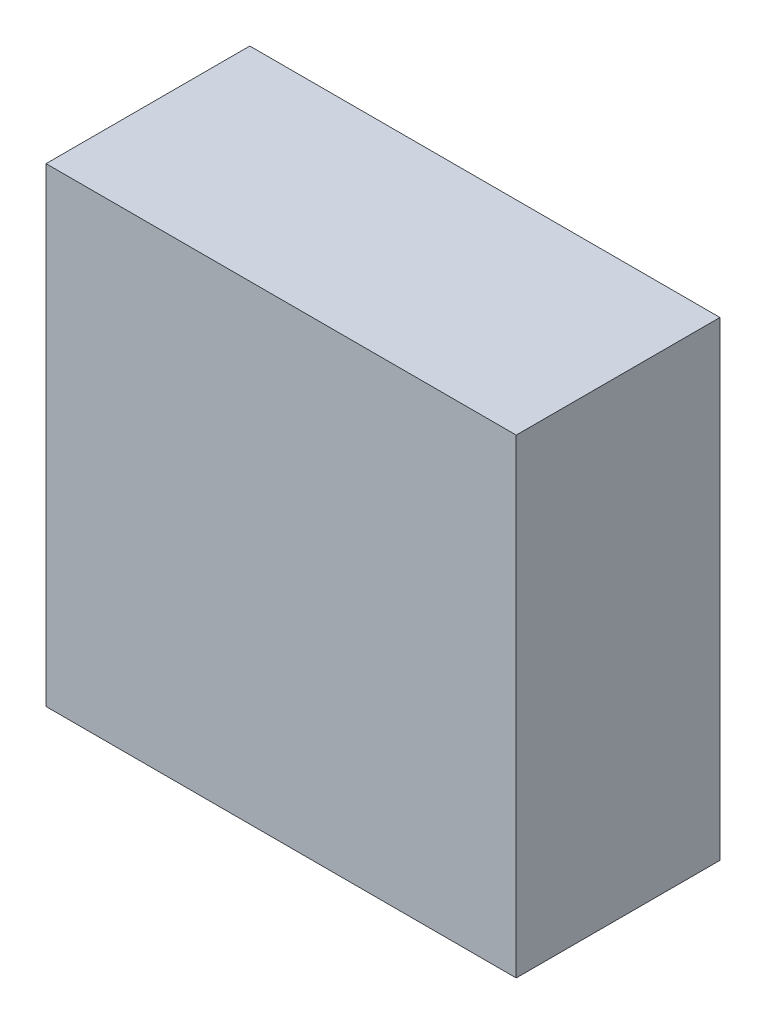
ISO-10303-21;
HEADER;
FILE_DESCRIPTION(('STEP AP214'),'2;1');
FILE_NAME('part.step','',(''),(''),'','','');
FILE_SCHEMA(('AUTOMOTIVE_DESIGN { 1 0 10303 214 1 1 1 1 }'));
ENDSEC;
DATA;
#1=APPLICATION_CONTEXT('core data for automotive mechanical design processes');
#2=APPLICATION_PROTOCOL_DEFINITION('international standard','automotive_design',2000,#1);
#3=PRODUCT_CONTEXT('',#1,'mechanical');
#4=PRODUCT('Part','Part','',(#3));
#5=PRODUCT_RELATED_PRODUCT_CATEGORY('part','',(#4));
#6=PRODUCT_DEFINITION_FORMATION('','',#4);
#7=PRODUCT_DEFINITION_CONTEXT('part definition',#1,'design');
#8=PRODUCT_DEFINITION('design','',#6,#7);
#9=PRODUCT_DEFINITION_SHAPE('','',#8);
#10=(LENGTH_UNIT() NAMED_UNIT(*) SI_UNIT(.MILLI.,.METRE.));
#11=(NAMED_UNIT(*) PLANE_ANGLE_UNIT() SI_UNIT($,.RADIAN.));
#12=(NAMED_UNIT(*) SI_UNIT($,.STERADIAN.) SOLID_ANGLE_UNIT());
#13=UNCERTAINTY_MEASURE_WITH_UNIT(LENGTH_MEASURE(1.E-05),#10,'distance_accuracy_value','');
#14=(GEOMETRIC_REPRESENTATION_CONTEXT(3) GLOBAL_UNCERTAINTY_ASSIGNED_CONTEXT((#13)) GLOBAL_UNIT_ASSIGNED_CONTEXT((#10,
#11,#12)) REPRESENTATION_CONTEXT('',''));
#15=CARTESIAN_POINT('',(0.,0.,0.));
#16=DIRECTION('',(0.,0.,1.));
#17=DIRECTION('',(1.,0.,0.));
#18=AXIS2_PLACEMENT_3D('',#15,#16,#17);
#19=CARTESIAN_POINT('',(1.5,1.5,1.3));
#20=DIRECTION('',(-1.,0.,0.));
#21=DIRECTION('',(0.,-1.,0.));
#22=AXIS2_PLACEMENT_3D('',#19,#20,#21);
#23=PLANE('',#22);
#24=DIRECTION('',(0.,1.,0.));
#25=VECTOR('',#24,1.);
#26=CARTESIAN_POINT('',(1.5,1.5,0.));
#27=LINE('',#26,#25);
#28=CARTESIAN_POINT('',(1.5,-1.5,0.));
#29=VERTEX_POINT('',#28);
#30=CARTESIAN_POINT('',(1.5,1.5,0.));
#31=VERTEX_POINT('',#30);
#32=EDGE_CURVE('E97',#29,#31,#27,.T.);
#33=ORIENTED_EDGE('',*,*,#32,.T.);
#34=DIRECTION('',(0.,0.,-1.));
#35=VECTOR('',#34,1.);
#36=CARTESIAN_POINT('',(1.5,1.5,1.3));
#37=LINE('',#36,#35);
#38=CARTESIAN_POINT('',(1.5,1.5,1.3));
#39=VERTEX_POINT('',#38);
#40=EDGE_CURVE('E11',#39,#31,#37,.T.);
#41=ORIENTED_EDGE('',*,*,#40,.F.);
#42=DIRECTION('',(0.,1.,0.));
#43=VECTOR('',#42,1.);
#44=CARTESIAN_POINT('',(1.5,1.5,1.3));
#45=LINE('',#44,#43);
#46=CARTESIAN_POINT('',(1.5,-1.5,1.3));
#47=VERTEX_POINT('',#46);
#48=EDGE_CURVE('E85',#47,#39,#45,.T.);
#49=ORIENTED_EDGE('',*,*,#48,.F.);
#50=DIRECTION('',(0.,0.,-1.));
#51=VECTOR('',#50,1.);
#52=CARTESIAN_POINT('',(1.5,-1.5,1.3));
#53=LINE('',#52,#51);
#54=EDGE_CURVE('E93',#47,#29,#53,.T.);
#55=ORIENTED_EDGE('',*,*,#54,.T.);
#56=EDGE_LOOP('',(#33,#41,#49,#55));
#57=FACE_BOUND('',#56,.T.);
#58=ADVANCED_FACE('F34',(#57),#23,.F.);
#59=CARTESIAN_POINT('',(-1.5,1.5,1.3));
#60=DIRECTION('',(0.,-1.,0.));
#61=DIRECTION('',(0.,0.,-1.));
#62=AXIS2_PLACEMENT_3D('',#59,#60,#61);
#63=PLANE('',#62);
#64=DIRECTION('',(-1.,0.,0.));
#65=VECTOR('',#64,1.);
#66=CARTESIAN_POINT('',(-1.5,1.5,0.));
#67=LINE('',#66,#65);
#68=CARTESIAN_POINT('',(-1.5,1.5,0.));
#69=VERTEX_POINT('',#68);
#70=EDGE_CURVE('E89',#31,#69,#67,.T.);
#71=ORIENTED_EDGE('',*,*,#70,.T.);
#72=DIRECTION('',(0.,0.,-1.));
#73=VECTOR('',#72,1.);
#74=CARTESIAN_POINT('',(-1.5,1.5,1.3));
#75=LINE('',#74,#73);
#76=CARTESIAN_POINT('',(-1.5,1.5,1.3));
#77=VERTEX_POINT('',#76);
#78=EDGE_CURVE('E42',#77,#69,#75,.T.);
#79=ORIENTED_EDGE('',*,*,#78,.F.);
#80=DIRECTION('',(-1.,0.,0.));
#81=VECTOR('',#80,1.);
#82=CARTESIAN_POINT('',(-1.5,1.5,1.3));
#83=LINE('',#82,#81);
#84=EDGE_CURVE('E80',#39,#77,#83,.T.);
#85=ORIENTED_EDGE('',*,*,#84,.F.);
#86=ORIENTED_EDGE('',*,*,#40,.T.);
#87=EDGE_LOOP('',(#71,#79,#85,#86));
#88=FACE_BOUND('',#87,.T.);
#89=ADVANCED_FACE('F88',(#88),#63,.F.);
#90=CARTESIAN_POINT('',(-1.5,1.5,1.3));
#91=DIRECTION('',(1.,0.,0.));
#92=DIRECTION('',(0.,1.,0.));
#93=AXIS2_PLACEMENT_3D('',#90,#91,#92);
#94=PLANE('',#93);
#95=DIRECTION('',(0.,-1.,0.));
#96=VECTOR('',#95,1.);
#97=CARTESIAN_POINT('',(-1.5,1.5,0.));
#98=LINE('',#97,#96);
#99=CARTESIAN_POINT('',(-1.5,-1.5,0.));
#100=VERTEX_POINT('',#99);
#101=EDGE_CURVE('E67',#69,#100,#98,.T.);
#102=ORIENTED_EDGE('',*,*,#101,.T.);
#103=DIRECTION('',(0.,0.,-1.));
#104=VECTOR('',#103,1.);
#105=CARTESIAN_POINT('',(-1.5,-1.5,1.3));
#106=LINE('',#105,#104);
#107=CARTESIAN_POINT('',(-1.5,-1.5,1.3));
#108=VERTEX_POINT('',#107);
#109=EDGE_CURVE('E90',#108,#100,#106,.T.);
#110=ORIENTED_EDGE('',*,*,#109,.F.);
#111=DIRECTION('',(0.,-1.,0.));
#112=VECTOR('',#111,1.);
#113=CARTESIAN_POINT('',(-1.5,1.5,1.3));
#114=LINE('',#113,#112);
#115=EDGE_CURVE('E83',#77,#108,#114,.T.);
#116=ORIENTED_EDGE('',*,*,#115,.F.);
#117=ORIENTED_EDGE('',*,*,#78,.T.);
#118=EDGE_LOOP('',(#102,#110,#116,#117));
#119=FACE_BOUND('',#118,.T.);
#120=ADVANCED_FACE('F91',(#119),#94,.F.);
#121=CARTESIAN_POINT('',(-1.5,-1.5,1.3));
#122=DIRECTION('',(0.,1.,0.));
#123=DIRECTION('',(0.,0.,1.));
#124=AXIS2_PLACEMENT_3D('',#121,#122,#123);
#125=PLANE('',#124);
#126=DIRECTION('',(1.,0.,0.));
#127=VECTOR('',#126,1.);
#128=CARTESIAN_POINT('',(-1.5,-1.5,0.));
#129=LINE('',#128,#127);
#130=EDGE_CURVE('E73',#100,#29,#129,.T.);
#131=ORIENTED_EDGE('',*,*,#130,.T.);
#132=ORIENTED_EDGE('',*,*,#54,.F.);
#133=DIRECTION('',(1.,0.,0.));
#134=VECTOR('',#133,1.);
#135=CARTESIAN_POINT('',(-1.5,-1.5,1.3));
#136=LINE('',#135,#134);
#137=EDGE_CURVE('E50',#108,#47,#136,.T.);
#138=ORIENTED_EDGE('',*,*,#137,.F.);
#139=ORIENTED_EDGE('',*,*,#109,.T.);
#140=EDGE_LOOP('',(#131,#132,#138,#139));
#141=FACE_BOUND('',#140,.T.);
#142=ADVANCED_FACE('F104',(#141),#125,.F.);
#143=CARTESIAN_POINT('',(0.,0.,1.3));
#144=DIRECTION('',(0.,0.,1.));
#145=DIRECTION('',(1.,0.,0.));
#146=AXIS2_PLACEMENT_3D('',#143,#144,#145);
#147=PLANE('',#146);
#148=ORIENTED_EDGE('',*,*,#48,.T.);
#149=ORIENTED_EDGE('',*,*,#84,.T.);
#150=ORIENTED_EDGE('',*,*,#115,.T.);
#151=ORIENTED_EDGE('',*,*,#137,.T.);
#152=EDGE_LOOP('',(#148,#149,#150,#151));
#153=FACE_BOUND('',#152,.T.);
#154=ADVANCED_FACE('F81',(#153),#147,.T.);
#155=CARTESIAN_POINT('',(0.,0.,0.));
#156=DIRECTION('',(0.,0.,1.));
#157=DIRECTION('',(1.,0.,0.));
#158=AXIS2_PLACEMENT_3D('',#155,#156,#157);
#159=PLANE('',#158);
#160=ORIENTED_EDGE('',*,*,#32,.F.);
#161=ORIENTED_EDGE('',*,*,#130,.F.);
#162=ORIENTED_EDGE('',*,*,#101,.F.);
#163=ORIENTED_EDGE('',*,*,#70,.F.);
#164=EDGE_LOOP('',(#160,#161,#162,#163));
#165=FACE_BOUND('',#164,.T.);
#166=ADVANCED_FACE('F107',(#165),#159,.F.);
#167=CLOSED_SHELL('',(#58,#89,#120,#142,#154,#166));
#168=MANIFOLD_SOLID_BREP('B2',#167);
#169=ADVANCED_BREP_SHAPE_REPRESENTATION('',(#18,#168),#14);
#170=SHAPE_DEFINITION_REPRESENTATION(#9,#169);
ENDSEC;
END-ISO-10303-21;
